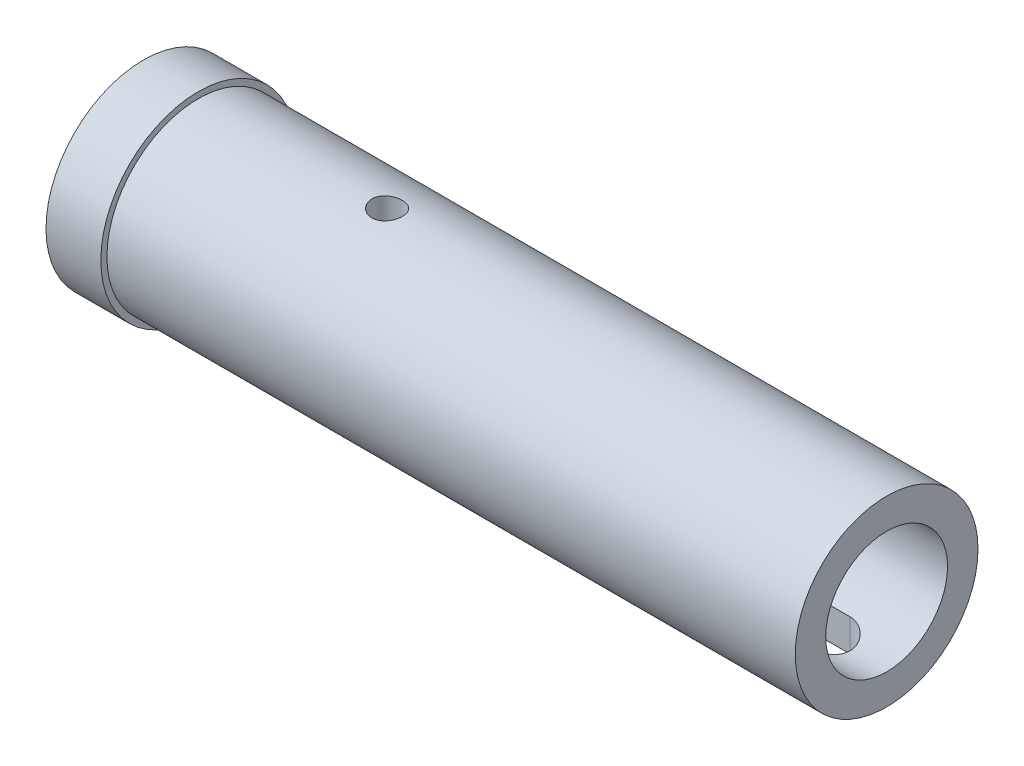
ISO-10303-21;
HEADER;
FILE_DESCRIPTION(('STEP AP214'),'2;1');
FILE_NAME('part.step','',(''),(''),'','','');
FILE_SCHEMA(('AUTOMOTIVE_DESIGN { 1 0 10303 214 1 1 1 1 }'));
ENDSEC;
DATA;
#1=APPLICATION_CONTEXT('core data for automotive mechanical design processes');
#2=APPLICATION_PROTOCOL_DEFINITION('international standard','automotive_design',2000,#1);
#3=PRODUCT_CONTEXT('',#1,'mechanical');
#4=PRODUCT('Part','Part','',(#3));
#5=PRODUCT_RELATED_PRODUCT_CATEGORY('part','',(#4));
#6=PRODUCT_DEFINITION_FORMATION('','',#4);
#7=PRODUCT_DEFINITION_CONTEXT('part definition',#1,'design');
#8=PRODUCT_DEFINITION('design','',#6,#7);
#9=PRODUCT_DEFINITION_SHAPE('','',#8);
#10=(LENGTH_UNIT() NAMED_UNIT(*) SI_UNIT(.MILLI.,.METRE.));
#11=(NAMED_UNIT(*) PLANE_ANGLE_UNIT() SI_UNIT($,.RADIAN.));
#12=(NAMED_UNIT(*) SI_UNIT($,.STERADIAN.) SOLID_ANGLE_UNIT());
#13=UNCERTAINTY_MEASURE_WITH_UNIT(LENGTH_MEASURE(1.E-05),#10,'distance_accuracy_value','');
#14=(GEOMETRIC_REPRESENTATION_CONTEXT(3) GLOBAL_UNCERTAINTY_ASSIGNED_CONTEXT((#13)) GLOBAL_UNIT_ASSIGNED_CONTEXT((#10,
#11,#12)) REPRESENTATION_CONTEXT('',''));
#15=CARTESIAN_POINT('',(0.,0.,0.));
#16=DIRECTION('',(0.,0.,1.));
#17=DIRECTION('',(1.,0.,0.));
#18=AXIS2_PLACEMENT_3D('',#15,#16,#17);
#19=CARTESIAN_POINT('',(50.001,0.,0.));
#20=DIRECTION('',(-1.,0.,0.));
#21=DIRECTION('',(0.,0.,1.));
#22=AXIS2_PLACEMENT_3D('',#19,#20,#21);
#23=CYLINDRICAL_SURFACE('',#22,10.);
#24=CARTESIAN_POINT('',(-60.,0.,0.));
#25=DIRECTION('',(-1.,0.,0.));
#26=DIRECTION('',(0.,0.,1.));
#27=AXIS2_PLACEMENT_3D('',#24,#25,#26);
#28=CIRCLE('',#27,10.);
#29=CARTESIAN_POINT('',(-60.,0.,10.));
#30=VERTEX_POINT('',#29);
#31=EDGE_CURVE('E42',#30,#30,#28,.F.);
#32=ORIENTED_EDGE('',*,*,#31,.F.);
#33=EDGE_LOOP('',(#32));
#34=FACE_BOUND('',#33,.T.);
#35=CARTESIAN_POINT('',(50.,0.,0.));
#36=DIRECTION('',(1.,0.,0.));
#37=DIRECTION('',(0.,0.,-1.));
#38=AXIS2_PLACEMENT_3D('',#35,#36,#37);
#39=CIRCLE('',#38,10.);
#40=CARTESIAN_POINT('',(50.,0.,-10.));
#41=VERTEX_POINT('',#40);
#42=EDGE_CURVE('E129',#41,#41,#39,.F.);
#43=ORIENTED_EDGE('',*,*,#42,.F.);
#44=EDGE_LOOP('',(#43));
#45=FACE_BOUND('',#44,.T.);
#46=DIRECTION('',(-1.,0.,0.));
#47=VECTOR('',#46,1.);
#48=CARTESIAN_POINT('',(50.001,-9.16515138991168,4.));
#49=LINE('',#48,#47);
#50=CARTESIAN_POINT('',(3.00000000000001,-9.16515138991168,4.));
#51=VERTEX_POINT('',#50);
#52=CARTESIAN_POINT('',(40.,-9.16515138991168,4.));
#53=VERTEX_POINT('',#52);
#54=EDGE_CURVE('E130',#51,#53,#49,.F.);
#55=ORIENTED_EDGE('',*,*,#54,.F.);
#56=CARTESIAN_POINT('',(3.00000000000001,-9.16515138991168,-4.));
#57=CARTESIAN_POINT('',(2.89238829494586,-9.16512928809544,-4.00001596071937));
#58=CARTESIAN_POINT('',(2.78478866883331,-9.16704612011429,-3.99565782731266));
#59=CARTESIAN_POINT('',(2.57045740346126,-9.17459250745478,-3.9783181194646));
#60=CARTESIAN_POINT('',(2.46372544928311,-9.18022064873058,-3.96533982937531));
#61=CARTESIAN_POINT('',(2.25230635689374,-9.19499565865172,-3.93095207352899));
#62=CARTESIAN_POINT('',(2.14761283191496,-9.20412861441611,-3.90957593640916));
#63=CARTESIAN_POINT('',(1.94059845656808,-9.22560106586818,-3.85863260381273));
#64=CARTESIAN_POINT('',(1.83827775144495,-9.23794075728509,-3.82906490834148));
#65=CARTESIAN_POINT('',(1.53612829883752,-9.2791858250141,-3.72853943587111));
#66=CARTESIAN_POINT('',(1.34069153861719,-9.3123489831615,-3.64568978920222));
#67=CARTESIAN_POINT('',(0.966408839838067,-9.3862474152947,-3.45096383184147));
#68=CARTESIAN_POINT('',(0.787578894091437,-9.42698987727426,-3.33905992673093));
#69=CARTESIAN_POINT('',(0.441475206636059,-9.51401998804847,-3.08263671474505));
#70=CARTESIAN_POINT('',(0.275265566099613,-9.56048491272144,-2.936738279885));
#71=CARTESIAN_POINT('',(-0.0310805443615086,-9.652255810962,-2.61939292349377));
#72=CARTESIAN_POINT('',(-0.171211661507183,-9.69756154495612,-2.44794076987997));
#73=CARTESIAN_POINT('',(-0.426812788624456,-9.78406834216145,-2.07601181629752));
#74=CARTESIAN_POINT('',(-0.541089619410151,-9.82503649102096,-1.87465586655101));
#75=CARTESIAN_POINT('',(-0.733688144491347,-9.89607888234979,-1.45364828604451));
#76=CARTESIAN_POINT('',(-0.81202484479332,-9.92615767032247,-1.2340043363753));
#77=CARTESIAN_POINT('',(-0.926682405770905,-9.97076629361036,-0.793934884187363));
#78=CARTESIAN_POINT('',(-0.964853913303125,-9.98597845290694,-0.574062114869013));
#79=CARTESIAN_POINT('',(-1.00405694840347,-10.001606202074,-0.130536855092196));
#80=CARTESIAN_POINT('',(-1.00510163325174,-10.0020270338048,0.0931142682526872));
#81=CARTESIAN_POINT('',(-0.971034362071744,-9.98843920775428,0.52446673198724));
#82=CARTESIAN_POINT('',(-0.937950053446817,-9.97523973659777,0.73235833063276));
#83=CARTESIAN_POINT('',(-0.840012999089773,-9.93698538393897,1.13934964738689));
#84=CARTESIAN_POINT('',(-0.775158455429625,-9.91192983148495,1.33844886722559));
#85=CARTESIAN_POINT('',(-0.61472796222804,-9.85193670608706,1.72579479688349));
#86=CARTESIAN_POINT('',(-0.518703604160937,-9.81685584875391,1.91383264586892));
#87=CARTESIAN_POINT('',(-0.299068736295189,-9.74029168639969,2.27161599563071));
#88=CARTESIAN_POINT('',(-0.175448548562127,-9.69880613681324,2.44135504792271));
#89=CARTESIAN_POINT('',(0.105280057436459,-9.61043706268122,2.76952257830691));
#90=CARTESIAN_POINT('',(0.264053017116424,-9.56337795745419,2.92647922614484));
#91=CARTESIAN_POINT('',(0.605992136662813,-9.47123359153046,3.21221470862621));
#92=CARTESIAN_POINT('',(0.789169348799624,-9.42614923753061,3.34098070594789));
#93=CARTESIAN_POINT('',(1.08163564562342,-9.36326134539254,3.51186134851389));
#94=CARTESIAN_POINT('',(1.18367183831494,-9.34283170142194,3.56571263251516));
#95=CARTESIAN_POINT('',(1.39239230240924,-9.30450957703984,3.6645476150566));
#96=CARTESIAN_POINT('',(1.49907454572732,-9.28661600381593,3.70953513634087));
#97=CARTESIAN_POINT('',(1.71622893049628,-9.25400250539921,3.79016254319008));
#98=CARTESIAN_POINT('',(1.82669617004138,-9.2392786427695,3.82581403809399));
#99=CARTESIAN_POINT('',(2.05066836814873,-9.2135146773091,3.88744848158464));
#100=CARTESIAN_POINT('',(2.16417194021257,-9.20247292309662,3.91343576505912));
#101=CARTESIAN_POINT('',(2.39744544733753,-9.18417798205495,3.95619393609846));
#102=CARTESIAN_POINT('',(2.51729419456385,-9.17707470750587,3.9726012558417));
#103=CARTESIAN_POINT('',(2.75809092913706,-9.16754485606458,3.99451448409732));
#104=CARTESIAN_POINT('',(2.87903819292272,-9.16511539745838,4.0000271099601));
#105=CARTESIAN_POINT('',(3.00000000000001,-9.16515138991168,4.));
#106=B_SPLINE_CURVE_WITH_KNOTS('',3,(#56,#57,#58,#59,#60,#61,#62,#63,#64,#65,#66,#67,#68,#69,
#70,#71,#72,#73,#74,#75,#76,#77,#78,#79,#80,#81,#82,#83,#84,#85,#86,#87,#88,#89,#90,#91,#92,#93,
#94,#95,#96,#97,#98,#99,#100,#101,#102,#103,#104,#105),.UNSPECIFIED.,.F.,.F.,(4,2,2,2,2,2,2,2,2,
2,2,2,2,2,2,2,2,2,2,2,2,2,2,2,4),(0.,0.322709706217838,0.645296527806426,0.966615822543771,
1.28795473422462,1.9293660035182,2.57138869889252,3.24636095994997,3.92147161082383,
4.62325717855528,5.32474946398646,5.99227753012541,6.65956903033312,7.28937830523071,
7.91922322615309,8.55856353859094,9.19812842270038,9.87963749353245,10.5614562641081,
10.9125878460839,11.2635676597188,11.614108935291,11.964492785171,12.3274303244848,
12.6901440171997),.UNSPECIFIED.);
#107=CARTESIAN_POINT('',(3.00000000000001,-9.16515138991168,-4.));
#108=VERTEX_POINT('',#107);
#109=EDGE_CURVE('E132',#108,#51,#106,.T.);
#110=ORIENTED_EDGE('',*,*,#109,.F.);
#111=DIRECTION('',(-1.,0.,0.));
#112=VECTOR('',#111,1.);
#113=CARTESIAN_POINT('',(50.001,-9.16515138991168,-4.));
#114=LINE('',#113,#112);
#115=CARTESIAN_POINT('',(40.,-9.16515138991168,-4.));
#116=VERTEX_POINT('',#115);
#117=EDGE_CURVE('E141',#116,#108,#114,.T.);
#118=ORIENTED_EDGE('',*,*,#117,.F.);
#119=CARTESIAN_POINT('',(40.,-9.16515138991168,4.));
#120=CARTESIAN_POINT('',(40.1076117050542,-9.16512928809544,4.00001596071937));
#121=CARTESIAN_POINT('',(40.2152113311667,-9.16704612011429,3.99565782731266));
#122=CARTESIAN_POINT('',(40.4295425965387,-9.17459250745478,3.9783181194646));
#123=CARTESIAN_POINT('',(40.5362745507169,-9.18022064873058,3.96533982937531));
#124=CARTESIAN_POINT('',(40.7476936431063,-9.19499565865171,3.93095207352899));
#125=CARTESIAN_POINT('',(40.8523871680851,-9.20412861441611,3.90957593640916));
#126=CARTESIAN_POINT('',(41.0594015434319,-9.22560106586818,3.85863260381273));
#127=CARTESIAN_POINT('',(41.1617222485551,-9.23794075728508,3.82906490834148));
#128=CARTESIAN_POINT('',(41.4638717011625,-9.2791858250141,3.72853943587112));
#129=CARTESIAN_POINT('',(41.6593084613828,-9.3123489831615,3.64568978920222));
#130=CARTESIAN_POINT('',(42.0335911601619,-9.38624741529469,3.45096383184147));
#131=CARTESIAN_POINT('',(42.2124211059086,-9.42698987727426,3.33905992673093));
#132=CARTESIAN_POINT('',(42.558524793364,-9.51401998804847,3.08263671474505));
#133=CARTESIAN_POINT('',(42.7247344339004,-9.56048491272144,2.936738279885));
#134=CARTESIAN_POINT('',(43.0310805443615,-9.652255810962,2.61939292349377));
#135=CARTESIAN_POINT('',(43.1712116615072,-9.69756154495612,2.44794076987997));
#136=CARTESIAN_POINT('',(43.4268127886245,-9.78406834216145,2.07601181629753));
#137=CARTESIAN_POINT('',(43.5410896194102,-9.82503649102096,1.87465586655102));
#138=CARTESIAN_POINT('',(43.7336881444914,-9.89607888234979,1.45364828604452));
#139=CARTESIAN_POINT('',(43.8120248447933,-9.92615767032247,1.2340043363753));
#140=CARTESIAN_POINT('',(43.9266824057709,-9.97076629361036,0.793934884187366));
#141=CARTESIAN_POINT('',(43.9648539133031,-9.98597845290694,0.574062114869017));
#142=CARTESIAN_POINT('',(44.0040569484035,-10.001606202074,0.130536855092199));
#143=CARTESIAN_POINT('',(44.0051016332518,-10.0020270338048,-0.0931142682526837));
#144=CARTESIAN_POINT('',(43.9710343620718,-9.98843920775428,-0.524466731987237));
#145=CARTESIAN_POINT('',(43.9379500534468,-9.97523973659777,-0.732358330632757));
#146=CARTESIAN_POINT('',(43.8400129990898,-9.93698538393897,-1.13934964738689));
#147=CARTESIAN_POINT('',(43.7751584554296,-9.91192983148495,-1.33844886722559));
#148=CARTESIAN_POINT('',(43.6147279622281,-9.85193670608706,-1.72579479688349));
#149=CARTESIAN_POINT('',(43.518703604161,-9.81685584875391,-1.91383264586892));
#150=CARTESIAN_POINT('',(43.2990687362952,-9.74029168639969,-2.27161599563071));
#151=CARTESIAN_POINT('',(43.1754485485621,-9.69880613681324,-2.4413550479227));
#152=CARTESIAN_POINT('',(42.8947199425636,-9.61043706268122,-2.76952257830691));
#153=CARTESIAN_POINT('',(42.7359469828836,-9.56337795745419,-2.92647922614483));
#154=CARTESIAN_POINT('',(42.3940078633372,-9.47123359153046,-3.2122147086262));
#155=CARTESIAN_POINT('',(42.2108306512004,-9.42614923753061,-3.34098070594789));
#156=CARTESIAN_POINT('',(41.9183643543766,-9.36326134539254,-3.51186134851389));
#157=CARTESIAN_POINT('',(41.8163281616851,-9.34283170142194,-3.56571263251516));
#158=CARTESIAN_POINT('',(41.6076076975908,-9.30450957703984,-3.6645476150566));
#159=CARTESIAN_POINT('',(41.5009254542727,-9.28661600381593,-3.70953513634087));
#160=CARTESIAN_POINT('',(41.2837710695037,-9.25400250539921,-3.79016254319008));
#161=CARTESIAN_POINT('',(41.1733038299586,-9.2392786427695,-3.82581403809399));
#162=CARTESIAN_POINT('',(40.9493316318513,-9.2135146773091,-3.88744848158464));
#163=CARTESIAN_POINT('',(40.8358280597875,-9.20247292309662,-3.91343576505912));
#164=CARTESIAN_POINT('',(40.6025545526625,-9.18417798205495,-3.95619393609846));
#165=CARTESIAN_POINT('',(40.4827058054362,-9.17707470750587,-3.9726012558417));
#166=CARTESIAN_POINT('',(40.241909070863,-9.16754485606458,-3.99451448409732));
#167=CARTESIAN_POINT('',(40.1209618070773,-9.16511539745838,-4.0000271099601));
#168=CARTESIAN_POINT('',(40.,-9.16515138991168,-4.));
#169=B_SPLINE_CURVE_WITH_KNOTS('',3,(#119,#120,#121,#122,#123,#124,#125,#126,#127,#128,#129,
#130,#131,#132,#133,#134,#135,#136,#137,#138,#139,#140,#141,#142,#143,#144,#145,#146,#147,#148,
#149,#150,#151,#152,#153,#154,#155,#156,#157,#158,#159,#160,#161,#162,#163,#164,#165,#166,#167,
#168),.UNSPECIFIED.,.F.,.F.,(4,2,2,2,2,2,2,2,2,2,2,2,2,2,2,2,2,2,2,2,2,2,2,2,4),(0.,
0.322709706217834,0.645296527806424,0.966615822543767,1.28795473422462,1.92936600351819,
2.57138869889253,3.24636095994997,3.92147161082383,4.62325717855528,5.32474946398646,
5.9922775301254,6.65956903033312,7.28937830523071,7.91922322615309,8.55856353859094,
9.19812842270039,9.87963749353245,10.5614562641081,10.9125878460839,11.2635676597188,
11.614108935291,11.964492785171,12.3274303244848,12.6901440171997),.UNSPECIFIED.);
#170=EDGE_CURVE('E54',#53,#116,#169,.T.);
#171=ORIENTED_EDGE('',*,*,#170,.F.);
#172=EDGE_LOOP('',(#55,#110,#118,#171));
#173=FACE_BOUND('',#172,.T.);
#174=CARTESIAN_POINT('',(-32.,9.68245836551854,-2.5));
#175=CARTESIAN_POINT('',(-32.1380507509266,9.6824610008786,-2.49999607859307));
#176=CARTESIAN_POINT('',(-32.2761448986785,9.68544306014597,-2.48852624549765));
#177=CARTESIAN_POINT('',(-32.5483675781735,9.69701861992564,-2.44302312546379));
#178=CARTESIAN_POINT('',(-32.6824937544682,9.7056153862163,-2.4089767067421));
#179=CARTESIAN_POINT('',(-32.9428035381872,9.7273872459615,-2.31949119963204));
#180=CARTESIAN_POINT('',(-33.0689971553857,9.74055642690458,-2.26407972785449));
#181=CARTESIAN_POINT('',(-33.3103108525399,9.76998192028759,-2.13352114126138));
#182=CARTESIAN_POINT('',(-33.4254304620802,9.78623836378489,-2.05837318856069));
#183=CARTESIAN_POINT('',(-33.6438616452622,9.82040716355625,-1.88870842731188));
#184=CARTESIAN_POINT('',(-33.74689360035,9.83834597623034,-1.79383688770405));
#185=CARTESIAN_POINT('',(-33.9357613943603,9.87362875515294,-1.58818206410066));
#186=CARTESIAN_POINT('',(-34.0215956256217,9.89097266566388,-1.47739729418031));
#187=CARTESIAN_POINT('',(-34.1747754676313,9.92340415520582,-1.24114520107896));
#188=CARTESIAN_POINT('',(-34.2418463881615,9.93845687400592,-1.11549457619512));
#189=CARTESIAN_POINT('',(-34.3538096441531,9.96430811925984,-0.854263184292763));
#190=CARTESIAN_POINT('',(-34.3987052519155,9.97510727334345,-0.718683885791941));
#191=CARTESIAN_POINT('',(-34.4641478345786,9.9910475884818,-0.444358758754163));
#192=CARTESIAN_POINT('',(-34.4851696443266,9.99629893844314,-0.305732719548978));
#193=CARTESIAN_POINT('',(-34.5037583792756,10.000935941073,-0.0268288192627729));
#194=CARTESIAN_POINT('',(-34.5013287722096,10.000322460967,0.113448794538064));
#195=CARTESIAN_POINT('',(-34.4734251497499,9.99338094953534,0.388380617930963));
#196=CARTESIAN_POINT('',(-34.4484636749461,9.98718002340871,0.523090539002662));
#197=CARTESIAN_POINT('',(-34.3770287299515,9.96990836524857,0.78634561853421));
#198=CARTESIAN_POINT('',(-34.3305541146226,9.95883737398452,0.91489044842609));
#199=CARTESIAN_POINT('',(-34.2169974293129,9.93287509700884,1.16351675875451));
#200=CARTESIAN_POINT('',(-34.1497329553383,9.91795019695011,1.28351127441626));
#201=CARTESIAN_POINT('',(-33.9966443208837,9.88589903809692,1.51068905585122));
#202=CARTESIAN_POINT('',(-33.9108169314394,9.8687723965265,1.61787008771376));
#203=CARTESIAN_POINT('',(-33.7202912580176,9.83363713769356,1.81943508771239));
#204=CARTESIAN_POINT('',(-33.6151451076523,9.81561719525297,1.91339419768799));
#205=CARTESIAN_POINT('',(-33.3904000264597,9.78115043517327,2.08244093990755));
#206=CARTESIAN_POINT('',(-33.2708004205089,9.76470369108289,2.15752769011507));
#207=CARTESIAN_POINT('',(-33.0197099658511,9.73520496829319,2.28697032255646));
#208=CARTESIAN_POINT('',(-32.8881642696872,9.72216983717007,2.34122391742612));
#209=CARTESIAN_POINT('',(-32.6174145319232,9.70118640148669,2.42671405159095));
#210=CARTESIAN_POINT('',(-32.4782121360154,9.69323700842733,2.45795551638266));
#211=CARTESIAN_POINT('',(-32.2000404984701,9.68355356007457,2.49582963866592));
#212=CARTESIAN_POINT('',(-32.061162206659,9.68166088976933,2.50309047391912));
#213=CARTESIAN_POINT('',(-31.7841780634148,9.68387343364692,2.49451699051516));
#214=CARTESIAN_POINT('',(-31.6460721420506,9.687978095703,2.4786847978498));
#215=CARTESIAN_POINT('',(-31.3768857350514,9.7015708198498,2.42492546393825));
#216=CARTESIAN_POINT('',(-31.2457272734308,9.71096970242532,2.3873640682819));
#217=CARTESIAN_POINT('',(-30.9915685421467,9.73400718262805,2.29161808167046));
#218=CARTESIAN_POINT('',(-30.8685692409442,9.74764628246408,2.2334310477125));
#219=CARTESIAN_POINT('',(-30.6315587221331,9.77796137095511,2.0967706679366));
#220=CARTESIAN_POINT('',(-30.517771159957,9.79469168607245,2.01792175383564));
#221=CARTESIAN_POINT('',(-30.3048116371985,9.82917083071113,1.84265073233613));
#222=CARTESIAN_POINT('',(-30.2056420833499,9.84691982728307,1.7462257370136));
#223=CARTESIAN_POINT('',(-30.0221889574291,9.88197403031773,1.53565680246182));
#224=CARTESIAN_POINT('',(-29.9383399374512,9.8992570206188,1.42112988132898));
#225=CARTESIAN_POINT('',(-29.7910641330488,9.93097216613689,1.17925670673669));
#226=CARTESIAN_POINT('',(-29.7276362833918,9.94540447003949,1.05191112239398));
#227=CARTESIAN_POINT('',(-29.6235539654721,9.96970115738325,0.788895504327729));
#228=CARTESIAN_POINT('',(-29.5827357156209,9.97959830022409,0.653293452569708));
#229=CARTESIAN_POINT('',(-29.5245396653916,9.99385293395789,0.376874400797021));
#230=CARTESIAN_POINT('',(-29.507157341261,9.99821149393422,0.236058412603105));
#231=CARTESIAN_POINT('',(-29.4965810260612,10.0008542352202,-0.0427088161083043));
#232=CARTESIAN_POINT('',(-29.5027457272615,9.99929947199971,-0.180634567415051));
#233=CARTESIAN_POINT('',(-29.5376195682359,9.99064741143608,-0.453418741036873));
#234=CARTESIAN_POINT('',(-29.5663280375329,9.98355027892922,-0.588277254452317));
#235=CARTESIAN_POINT('',(-29.6451305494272,9.96463582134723,-0.850427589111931));
#236=CARTESIAN_POINT('',(-29.6951086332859,9.95284411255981,-0.977756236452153));
#237=CARTESIAN_POINT('',(-29.8149264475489,9.92578222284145,-1.22229263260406));
#238=CARTESIAN_POINT('',(-29.8847686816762,9.91051160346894,-1.33949910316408));
#239=CARTESIAN_POINT('',(-30.0442880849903,9.87768124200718,-1.56350482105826));
#240=CARTESIAN_POINT('',(-30.1344003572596,9.86007542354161,-1.66998747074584));
#241=CARTESIAN_POINT('',(-30.3310571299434,9.82476622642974,-1.86653755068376));
#242=CARTESIAN_POINT('',(-30.4376057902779,9.80706282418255,-1.95660081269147));
#243=CARTESIAN_POINT('',(-30.6665035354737,9.77318689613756,-2.11940506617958));
#244=CARTESIAN_POINT('',(-30.7891103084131,9.75704909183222,-2.19179154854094));
#245=CARTESIAN_POINT('',(-31.045138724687,9.7285988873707,-2.31481724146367));
#246=CARTESIAN_POINT('',(-31.1785524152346,9.71628370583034,-2.36547227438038));
#247=CARTESIAN_POINT('',(-31.4264425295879,9.69879771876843,-2.43605632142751));
#248=CARTESIAN_POINT('',(-31.5397329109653,9.69271657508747,-2.4599829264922));
#249=CARTESIAN_POINT('',(-31.7686721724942,9.6845459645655,-2.49195573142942));
#250=CARTESIAN_POINT('',(-31.884320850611,9.6824561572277,-2.50000328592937));
#251=CARTESIAN_POINT('',(-32.,9.68245836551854,-2.5));
#252=B_SPLINE_CURVE_WITH_KNOTS('',3,(#174,#175,#176,#177,#178,#179,#180,#181,#182,#183,#184,
#185,#186,#187,#188,#189,#190,#191,#192,#193,#194,#195,#196,#197,#198,#199,#200,#201,#202,#203,
#204,#205,#206,#207,#208,#209,#210,#211,#212,#213,#214,#215,#216,#217,#218,#219,#220,#221,#222,
#223,#224,#225,#226,#227,#228,#229,#230,#231,#232,#233,#234,#235,#236,#237,#238,#239,#240,#241,
#242,#243,#244,#245,#246,#247,#248,#249,#250,#251),.UNSPECIFIED.,.T.,.F.,(4,2,2,2,2,2,2,2,2,2,2,
2,2,2,2,2,2,2,2,2,2,2,2,2,2,2,2,2,2,2,2,2,2,2,2,2,2,2,4),(0.,0.413727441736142,
0.827695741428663,1.24113072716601,1.65458326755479,2.07623954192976,2.49793521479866,
2.9255149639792,3.35303159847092,3.77188750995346,4.1906814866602,4.60018262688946,
5.00970556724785,5.42292874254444,5.83622385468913,6.26070466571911,6.68520531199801,
7.11176432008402,7.53823200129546,7.95343574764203,8.36860127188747,8.77697405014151,
9.18539521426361,9.60182845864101,10.0183301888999,10.4452533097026,10.872154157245,
11.2959207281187,11.7196054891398,12.131834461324,12.5440511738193,12.9540487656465,
13.3640980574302,13.7839709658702,14.2039503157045,14.6317647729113,15.0592672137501,
15.4059782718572,15.7526597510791),.UNSPECIFIED.);
#253=CARTESIAN_POINT('',(-32.,9.68245836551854,-2.5));
#254=VERTEX_POINT('',#253);
#255=EDGE_CURVE('E227',#254,#254,#252,.T.);
#256=ORIENTED_EDGE('',*,*,#255,.T.);
#257=EDGE_LOOP('',(#256));
#258=FACE_BOUND('',#257,.T.);
#259=ADVANCED_FACE('F38',(#34,#45,#173,#258),#23,.F.);
#260=CARTESIAN_POINT('',(50.,0.,0.));
#261=DIRECTION('',(1.,0.,0.));
#262=DIRECTION('',(0.,0.,-1.));
#263=AXIS2_PLACEMENT_3D('',#260,#261,#262);
#264=CYLINDRICAL_SURFACE('',#263,15.);
#265=DIRECTION('',(1.,0.,0.));
#266=VECTOR('',#265,1.);
#267=CARTESIAN_POINT('',(50.,-14.4568322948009,-4.));
#268=LINE('',#267,#266);
#269=CARTESIAN_POINT('',(40.,-14.4568322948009,-4.));
#270=VERTEX_POINT('',#269);
#271=CARTESIAN_POINT('',(3.00000000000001,-14.4568322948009,-4.));
#272=VERTEX_POINT('',#271);
#273=EDGE_CURVE('E11',#270,#272,#268,.F.);
#274=ORIENTED_EDGE('',*,*,#273,.T.);
#275=CARTESIAN_POINT('',(3.00000000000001,-14.4568322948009,-4.));
#276=CARTESIAN_POINT('',(2.88964175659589,-14.4568189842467,-4.00001309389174));
#277=CARTESIAN_POINT('',(2.77929147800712,-14.4580956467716,-3.99543311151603));
#278=CARTESIAN_POINT('',(2.55942134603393,-14.4631301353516,-3.97718874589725));
#279=CARTESIAN_POINT('',(2.44990134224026,-14.4668875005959,-3.96352604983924));
#280=CARTESIAN_POINT('',(2.23269834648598,-14.4767740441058,-3.92725695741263));
#281=CARTESIAN_POINT('',(2.12501191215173,-14.4828981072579,-3.90466984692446));
#282=CARTESIAN_POINT('',(1.91202513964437,-14.4973231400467,-3.85076543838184));
#283=CARTESIAN_POINT('',(1.80672484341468,-14.5056241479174,-3.81944798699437));
#284=CARTESIAN_POINT('',(1.49553658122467,-14.5334412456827,-3.71275643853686));
#285=CARTESIAN_POINT('',(1.29412506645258,-14.5558829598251,-3.62460332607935));
#286=CARTESIAN_POINT('',(0.908979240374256,-14.6060171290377,-3.4169578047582));
#287=CARTESIAN_POINT('',(0.72525079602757,-14.6337113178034,-3.29745504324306));
#288=CARTESIAN_POINT('',(0.376029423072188,-14.6920016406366,-3.0273032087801));
#289=CARTESIAN_POINT('',(0.211038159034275,-14.7226489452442,-2.87601544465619));
#290=CARTESIAN_POINT('',(-0.0915575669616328,-14.7829523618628,-2.54795832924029));
#291=CARTESIAN_POINT('',(-0.229157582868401,-14.8126083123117,-2.37118484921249));
#292=CARTESIAN_POINT('',(-0.475172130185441,-14.8681604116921,-1.99367199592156));
#293=CARTESIAN_POINT('',(-0.583083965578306,-14.8939887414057,-1.79259414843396));
#294=CARTESIAN_POINT('',(-0.763372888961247,-14.9383834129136,-1.3743557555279));
#295=CARTESIAN_POINT('',(-0.835757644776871,-14.9569513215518,-1.15719869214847));
#296=CARTESIAN_POINT('',(-0.941309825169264,-14.9843709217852,-0.718234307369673));
#297=CARTESIAN_POINT('',(-0.975337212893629,-14.9934353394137,-0.496647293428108));
#298=CARTESIAN_POINT('',(-1.00591431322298,-15.0015705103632,-0.0507319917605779));
#299=CARTESIAN_POINT('',(-1.00246948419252,-15.0006427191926,0.173595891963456));
#300=CARTESIAN_POINT('',(-0.958804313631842,-14.9890534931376,0.612629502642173));
#301=CARTESIAN_POINT('',(-0.919513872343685,-14.9786381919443,0.827435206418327));
#302=CARTESIAN_POINT('',(-0.806774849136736,-14.9495347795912,1.24728467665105));
#303=CARTESIAN_POINT('',(-0.733324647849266,-14.9308462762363,1.45232797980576));
#304=CARTESIAN_POINT('',(-0.55364003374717,-14.8869312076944,1.84920963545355));
#305=CARTESIAN_POINT('',(-0.447086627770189,-14.8616414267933,2.04089626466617));
#306=CARTESIAN_POINT('',(-0.204457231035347,-14.8072486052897,2.40398441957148));
#307=CARTESIAN_POINT('',(-0.0683760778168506,-14.7781448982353,2.57538239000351));
#308=CARTESIAN_POINT('',(0.234327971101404,-14.7182294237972,2.89854935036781));
#309=CARTESIAN_POINT('',(0.401758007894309,-14.6873926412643,3.04955722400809));
#310=CARTESIAN_POINT('',(0.760042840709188,-14.6282716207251,3.32161448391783));
#311=CARTESIAN_POINT('',(0.950904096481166,-14.5999880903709,3.4426555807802));
#312=CARTESIAN_POINT('',(1.25135328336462,-14.5618587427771,3.59932937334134));
#313=CARTESIAN_POINT('',(1.35428891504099,-14.5498268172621,3.64754371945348));
#314=CARTESIAN_POINT('',(1.56404632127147,-14.5275984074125,3.73509417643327));
#315=CARTESIAN_POINT('',(1.67086651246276,-14.5174011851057,3.77443385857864));
#316=CARTESIAN_POINT('',(1.8875194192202,-14.4991713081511,3.843867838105));
#317=CARTESIAN_POINT('',(1.99734887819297,-14.4911364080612,3.87397173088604));
#318=CARTESIAN_POINT('',(2.21927522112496,-14.4774747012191,3.92471856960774));
#319=CARTESIAN_POINT('',(2.33137102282,-14.4718467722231,3.9453659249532));
#320=CARTESIAN_POINT('',(2.53625102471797,-14.4639761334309,3.97411378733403));
#321=CARTESIAN_POINT('',(2.62879644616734,-14.4613012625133,3.98382319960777));
#322=CARTESIAN_POINT('',(2.81422535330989,-14.4577275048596,3.99676420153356));
#323=CARTESIAN_POINT('',(2.90710807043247,-14.4568258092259,4.00000603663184));
#324=CARTESIAN_POINT('',(3.00000000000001,-14.4568322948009,4.));
#325=B_SPLINE_CURVE_WITH_KNOTS('',3,(#275,#276,#277,#278,#279,#280,#281,#282,#283,#284,#285,
#286,#287,#288,#289,#290,#291,#292,#293,#294,#295,#296,#297,#298,#299,#300,#301,#302,#303,#304,
#305,#306,#307,#308,#309,#310,#311,#312,#313,#314,#315,#316,#317,#318,#319,#320,#321,#322,#323,
#324),.UNSPECIFIED.,.F.,.F.,(4,2,2,2,2,2,2,2,2,2,2,2,2,2,2,2,2,2,2,2,2,2,2,2,4),(0.,
0.330958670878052,0.661855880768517,0.992041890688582,1.32223370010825,1.98190700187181,
2.64179842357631,3.3164963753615,3.99130375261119,4.67691814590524,5.36238449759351,
6.03215661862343,6.7018311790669,7.35461236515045,8.00742449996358,8.66673340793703,
9.32615767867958,10.0057598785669,10.6855498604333,11.0281077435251,11.3705275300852,
11.7125903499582,12.0544935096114,12.3335333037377,12.6121307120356),.UNSPECIFIED.);
#326=CARTESIAN_POINT('',(3.00000000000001,-14.4568322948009,4.));
#327=VERTEX_POINT('',#326);
#328=EDGE_CURVE('E177',#272,#327,#325,.T.);
#329=ORIENTED_EDGE('',*,*,#328,.T.);
#330=DIRECTION('',(1.,0.,0.));
#331=VECTOR('',#330,1.);
#332=CARTESIAN_POINT('',(50.,-14.4568322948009,4.));
#333=LINE('',#332,#331);
#334=CARTESIAN_POINT('',(40.,-14.4568322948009,4.));
#335=VERTEX_POINT('',#334);
#336=EDGE_CURVE('E47',#327,#335,#333,.T.);
#337=ORIENTED_EDGE('',*,*,#336,.T.);
#338=CARTESIAN_POINT('',(40.,-14.4568322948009,4.));
#339=CARTESIAN_POINT('',(40.1103582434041,-14.4568189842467,4.00001309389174));
#340=CARTESIAN_POINT('',(40.2207085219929,-14.4580956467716,3.99543311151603));
#341=CARTESIAN_POINT('',(40.4405786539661,-14.4631301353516,3.97718874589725));
#342=CARTESIAN_POINT('',(40.5500986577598,-14.4668875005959,3.96352604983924));
#343=CARTESIAN_POINT('',(40.767301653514,-14.4767740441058,3.92725695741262));
#344=CARTESIAN_POINT('',(40.8749880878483,-14.4828981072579,3.90466984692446));
#345=CARTESIAN_POINT('',(41.0879748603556,-14.4973231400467,3.85076543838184));
#346=CARTESIAN_POINT('',(41.1932751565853,-14.5056241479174,3.81944798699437));
#347=CARTESIAN_POINT('',(41.5044634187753,-14.5334412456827,3.71275643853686));
#348=CARTESIAN_POINT('',(41.7058749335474,-14.5558829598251,3.62460332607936));
#349=CARTESIAN_POINT('',(42.0910207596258,-14.6060171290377,3.4169578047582));
#350=CARTESIAN_POINT('',(42.2747492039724,-14.6337113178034,3.29745504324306));
#351=CARTESIAN_POINT('',(42.6239705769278,-14.6920016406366,3.0273032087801));
#352=CARTESIAN_POINT('',(42.7889618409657,-14.7226489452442,2.87601544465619));
#353=CARTESIAN_POINT('',(43.0915575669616,-14.7829523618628,2.54795832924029));
#354=CARTESIAN_POINT('',(43.2291575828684,-14.8126083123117,2.37118484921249));
#355=CARTESIAN_POINT('',(43.4751721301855,-14.8681604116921,1.99367199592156));
#356=CARTESIAN_POINT('',(43.5830839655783,-14.8939887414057,1.79259414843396));
#357=CARTESIAN_POINT('',(43.7633728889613,-14.9383834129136,1.37435575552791));
#358=CARTESIAN_POINT('',(43.8357576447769,-14.9569513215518,1.15719869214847));
#359=CARTESIAN_POINT('',(43.9413098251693,-14.9843709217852,0.718234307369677));
#360=CARTESIAN_POINT('',(43.9753372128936,-14.9934353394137,0.496647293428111));
#361=CARTESIAN_POINT('',(44.005914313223,-15.0015705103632,0.0507319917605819));
#362=CARTESIAN_POINT('',(44.0024694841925,-15.0006427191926,-0.173595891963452));
#363=CARTESIAN_POINT('',(43.9588043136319,-14.9890534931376,-0.612629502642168));
#364=CARTESIAN_POINT('',(43.9195138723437,-14.9786381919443,-0.827435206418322));
#365=CARTESIAN_POINT('',(43.8067748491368,-14.9495347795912,-1.24728467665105));
#366=CARTESIAN_POINT('',(43.7333246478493,-14.9308462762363,-1.45232797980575));
#367=CARTESIAN_POINT('',(43.5536400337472,-14.8869312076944,-1.84920963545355));
#368=CARTESIAN_POINT('',(43.4470866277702,-14.8616414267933,-2.04089626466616));
#369=CARTESIAN_POINT('',(43.2044572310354,-14.8072486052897,-2.40398441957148));
#370=CARTESIAN_POINT('',(43.0683760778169,-14.7781448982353,-2.5753823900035));
#371=CARTESIAN_POINT('',(42.7656720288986,-14.7182294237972,-2.8985493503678));
#372=CARTESIAN_POINT('',(42.5982419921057,-14.6873926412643,-3.04955722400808));
#373=CARTESIAN_POINT('',(42.2399571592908,-14.6282716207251,-3.32161448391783));
#374=CARTESIAN_POINT('',(42.0490959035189,-14.5999880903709,-3.4426555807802));
#375=CARTESIAN_POINT('',(41.7486467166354,-14.5618587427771,-3.59932937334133));
#376=CARTESIAN_POINT('',(41.645711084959,-14.5498268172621,-3.64754371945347));
#377=CARTESIAN_POINT('',(41.4359536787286,-14.5275984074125,-3.73509417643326));
#378=CARTESIAN_POINT('',(41.3291334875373,-14.5174011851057,-3.77443385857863));
#379=CARTESIAN_POINT('',(41.1124805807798,-14.4991713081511,-3.843867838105));
#380=CARTESIAN_POINT('',(41.0026511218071,-14.4911364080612,-3.87397173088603));
#381=CARTESIAN_POINT('',(40.7807247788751,-14.4774747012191,-3.92471856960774));
#382=CARTESIAN_POINT('',(40.66862897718,-14.4718467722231,-3.9453659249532));
#383=CARTESIAN_POINT('',(40.463748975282,-14.4639761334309,-3.97411378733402));
#384=CARTESIAN_POINT('',(40.3712035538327,-14.4613012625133,-3.98382319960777));
#385=CARTESIAN_POINT('',(40.1857746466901,-14.4577275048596,-3.99676420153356));
#386=CARTESIAN_POINT('',(40.0928919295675,-14.4568258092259,-4.00000603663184));
#387=CARTESIAN_POINT('',(40.,-14.4568322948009,-4.));
#388=B_SPLINE_CURVE_WITH_KNOTS('',3,(#338,#339,#340,#341,#342,#343,#344,#345,#346,#347,#348,
#349,#350,#351,#352,#353,#354,#355,#356,#357,#358,#359,#360,#361,#362,#363,#364,#365,#366,#367,
#368,#369,#370,#371,#372,#373,#374,#375,#376,#377,#378,#379,#380,#381,#382,#383,#384,#385,#386,
#387),.UNSPECIFIED.,.F.,.F.,(4,2,2,2,2,2,2,2,2,2,2,2,2,2,2,2,2,2,2,2,2,2,2,2,4),(0.,
0.330958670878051,0.661855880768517,0.992041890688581,1.32223370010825,1.98190700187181,
2.64179842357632,3.31649637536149,3.99130375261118,4.67691814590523,5.3623844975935,
6.03215661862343,6.7018311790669,7.35461236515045,8.00742449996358,8.66673340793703,
9.32615767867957,10.0057598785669,10.6855498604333,11.0281077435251,11.3705275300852,
11.7125903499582,12.0544935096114,12.3335333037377,12.6121307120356),.UNSPECIFIED.);
#389=EDGE_CURVE('E186',#335,#270,#388,.T.);
#390=ORIENTED_EDGE('',*,*,#389,.T.);
#391=EDGE_LOOP('',(#274,#329,#337,#390));
#392=FACE_BOUND('',#391,.T.);
#393=CARTESIAN_POINT('',(50.,0.,0.));
#394=DIRECTION('',(1.,0.,0.));
#395=DIRECTION('',(0.,0.,-1.));
#396=AXIS2_PLACEMENT_3D('',#393,#394,#395);
#397=CIRCLE('',#396,15.);
#398=CARTESIAN_POINT('',(50.,0.,-15.));
#399=VERTEX_POINT('',#398);
#400=EDGE_CURVE('E165',#399,#399,#397,.T.);
#401=ORIENTED_EDGE('',*,*,#400,.F.);
#402=EDGE_LOOP('',(#401));
#403=FACE_BOUND('',#402,.T.);
#404=CARTESIAN_POINT('',(-63.,0.,0.));
#405=DIRECTION('',(1.,0.,0.));
#406=DIRECTION('',(0.,0.,-1.));
#407=AXIS2_PLACEMENT_3D('',#404,#405,#406);
#408=CIRCLE('',#407,15.);
#409=CARTESIAN_POINT('',(-63.,0.,-15.));
#410=VERTEX_POINT('',#409);
#411=EDGE_CURVE('E168',#410,#410,#408,.T.);
#412=ORIENTED_EDGE('',*,*,#411,.T.);
#413=EDGE_LOOP('',(#412));
#414=FACE_BOUND('',#413,.T.);
#415=CARTESIAN_POINT('',(-32.,14.790199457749,-2.5));
#416=CARTESIAN_POINT('',(-32.1393757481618,14.790201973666,-2.49999439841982));
#417=CARTESIAN_POINT('',(-32.2788276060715,14.7921909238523,-2.48830516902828));
#418=CARTESIAN_POINT('',(-32.5538185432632,14.7999245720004,-2.44187742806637));
#419=CARTESIAN_POINT('',(-32.6893538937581,14.8056727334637,-2.40711766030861));
#420=CARTESIAN_POINT('',(-32.9524922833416,14.8202560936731,-2.31562954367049));
#421=CARTESIAN_POINT('',(-33.0801018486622,14.8290887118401,-2.25891955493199));
#422=CARTESIAN_POINT('',(-33.3239809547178,14.8488427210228,-2.12518649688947));
#423=CARTESIAN_POINT('',(-33.4402517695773,14.8597638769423,-2.04816571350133));
#424=CARTESIAN_POINT('',(-33.6593128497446,14.8825847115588,-1.87518752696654));
#425=CARTESIAN_POINT('',(-33.7619751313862,14.8944921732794,-1.77906904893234));
#426=CARTESIAN_POINT('',(-33.9497933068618,14.9178748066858,-1.57097200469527));
#427=CARTESIAN_POINT('',(-34.0349481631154,14.9293499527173,-1.45899249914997));
#428=CARTESIAN_POINT('',(-34.1858145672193,14.9506573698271,-1.22152286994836));
#429=CARTESIAN_POINT('',(-34.2514070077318,14.9604794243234,-1.09595608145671));
#430=CARTESIAN_POINT('',(-34.3605210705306,14.9772873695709,-0.835395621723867));
#431=CARTESIAN_POINT('',(-34.4040441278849,14.9842734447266,-0.700402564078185));
#432=CARTESIAN_POINT('',(-34.4673925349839,14.9945673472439,-0.426143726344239));
#433=CARTESIAN_POINT('',(-34.4874329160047,14.9979085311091,-0.286928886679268));
#434=CARTESIAN_POINT('',(-34.5039157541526,15.0006507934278,-0.00707528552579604));
#435=CARTESIAN_POINT('',(-34.5003598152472,15.0000521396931,0.133563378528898));
#436=CARTESIAN_POINT('',(-34.4699186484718,14.9950085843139,0.410802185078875));
#437=CARTESIAN_POINT('',(-34.4432648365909,14.990601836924,0.54742853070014));
#438=CARTESIAN_POINT('',(-34.3677489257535,14.9784797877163,0.81424197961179));
#439=CARTESIAN_POINT('',(-34.3188861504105,14.9707643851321,0.944428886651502));
#440=CARTESIAN_POINT('',(-34.2001093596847,14.9528269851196,1.19535614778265));
#441=CARTESIAN_POINT('',(-34.1300999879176,14.9425936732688,1.31605052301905));
#442=CARTESIAN_POINT('',(-33.971087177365,14.920757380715,1.54406552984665));
#443=CARTESIAN_POINT('',(-33.8820822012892,14.9091542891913,1.65138507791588));
#444=CARTESIAN_POINT('',(-33.6863211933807,14.8857026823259,1.85097127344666));
#445=CARTESIAN_POINT('',(-33.579362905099,14.8738528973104,1.94303950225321));
#446=CARTESIAN_POINT('',(-33.3514129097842,14.851379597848,2.10795458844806));
#447=CARTESIAN_POINT('',(-33.2304210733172,14.8407560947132,2.18080126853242));
#448=CARTESIAN_POINT('',(-32.9776083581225,14.8219375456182,2.30524443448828));
#449=CARTESIAN_POINT('',(-32.8457755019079,14.813745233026,2.35681702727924));
#450=CARTESIAN_POINT('',(-32.5751509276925,14.8007618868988,2.43702987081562));
#451=CARTESIAN_POINT('',(-32.4363598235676,14.7959705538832,2.46567214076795));
#452=CARTESIAN_POINT('',(-32.1575338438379,14.7903895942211,2.49893188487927));
#453=CARTESIAN_POINT('',(-32.0175336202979,14.7895528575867,2.50383220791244));
#454=CARTESIAN_POINT('',(-31.7387133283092,14.7918503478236,2.49022270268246));
#455=CARTESIAN_POINT('',(-31.599893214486,14.7949844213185,2.47171377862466));
#456=CARTESIAN_POINT('',(-31.3282722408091,14.8048268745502,2.4120523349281));
#457=CARTESIAN_POINT('',(-31.195438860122,14.8115125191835,2.37104379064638));
#458=CARTESIAN_POINT('',(-30.9385298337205,14.827685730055,2.26769819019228));
#459=CARTESIAN_POINT('',(-30.8144547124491,14.8371734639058,2.20535985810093));
#460=CARTESIAN_POINT('',(-30.5773254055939,14.8579912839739,2.06045667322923));
#461=CARTESIAN_POINT('',(-30.4643834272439,14.8693375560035,1.97771056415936));
#462=CARTESIAN_POINT('',(-30.253886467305,14.8925466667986,1.79458946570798));
#463=CARTESIAN_POINT('',(-30.1563325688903,14.9044095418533,1.69421323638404));
#464=CARTESIAN_POINT('',(-29.9783481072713,14.9274642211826,1.47742807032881));
#465=CARTESIAN_POINT('',(-29.8981061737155,14.9386477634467,1.3608632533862));
#466=CARTESIAN_POINT('',(-29.7583446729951,14.9589511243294,1.11574344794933));
#467=CARTESIAN_POINT('',(-29.6988244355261,14.9680710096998,0.987188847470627));
#468=CARTESIAN_POINT('',(-29.6024894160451,14.9831835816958,0.722299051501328));
#469=CARTESIAN_POINT('',(-29.5655759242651,14.9891898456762,0.586000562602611));
#470=CARTESIAN_POINT('',(-29.5151844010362,14.9974558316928,0.30903073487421));
#471=CARTESIAN_POINT('',(-29.5017044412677,14.9997158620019,0.16835975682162));
#472=CARTESIAN_POINT('',(-29.4986181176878,15.0002303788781,-0.111541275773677));
#473=CARTESIAN_POINT('',(-29.5087247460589,14.9985330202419,-0.250768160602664));
#474=CARTESIAN_POINT('',(-29.5519039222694,14.9914217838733,-0.525511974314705));
#475=CARTESIAN_POINT('',(-29.5849763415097,14.9860079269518,-0.661028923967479));
#476=CARTESIAN_POINT('',(-29.6730381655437,14.972069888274,-0.924396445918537));
#477=CARTESIAN_POINT('',(-29.72800316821,14.9635491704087,-1.05225537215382));
#478=CARTESIAN_POINT('',(-29.8582579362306,14.9443275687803,-1.29698045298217));
#479=CARTESIAN_POINT('',(-29.9335486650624,14.9336265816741,-1.41384608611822));
#480=CARTESIAN_POINT('',(-30.1033350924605,14.9110762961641,-1.63471294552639));
#481=CARTESIAN_POINT('',(-30.1980409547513,14.8992152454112,-1.73855143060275));
#482=CARTESIAN_POINT('',(-30.4035283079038,14.8757630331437,-1.92896387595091));
#483=CARTESIAN_POINT('',(-30.5143135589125,14.8641719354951,-2.0155337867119));
#484=CARTESIAN_POINT('',(-30.7497453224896,14.8424834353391,-2.16951427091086));
#485=CARTESIAN_POINT('',(-30.8744843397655,14.8323971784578,-2.2367849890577));
#486=CARTESIAN_POINT('',(-31.1336092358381,14.8149921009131,-2.34931453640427));
#487=CARTESIAN_POINT('',(-31.2679853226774,14.8076705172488,-2.39459535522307));
#488=CARTESIAN_POINT('',(-31.5024037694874,14.7982474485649,-2.45202605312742));
#489=CARTESIAN_POINT('',(-31.6010268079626,14.7952462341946,-2.46998741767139));
#490=CARTESIAN_POINT('',(-31.7997534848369,14.7912213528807,-2.49397629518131));
#491=CARTESIAN_POINT('',(-31.8998570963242,14.7901976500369,-2.50000402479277));
#492=CARTESIAN_POINT('',(-32.,14.790199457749,-2.5));
#493=B_SPLINE_CURVE_WITH_KNOTS('',3,(#415,#416,#417,#418,#419,#420,#421,#422,#423,#424,#425,
#426,#427,#428,#429,#430,#431,#432,#433,#434,#435,#436,#437,#438,#439,#440,#441,#442,#443,#444,
#445,#446,#447,#448,#449,#450,#451,#452,#453,#454,#455,#456,#457,#458,#459,#460,#461,#462,#463,
#464,#465,#466,#467,#468,#469,#470,#471,#472,#473,#474,#475,#476,#477,#478,#479,#480,#481,#482,
#483,#484,#485,#486,#487,#488,#489,#490,#491,#492),.UNSPECIFIED.,.T.,.F.,(4,2,2,2,2,2,2,2,2,2,2,
2,2,2,2,2,2,2,2,2,2,2,2,2,2,2,2,2,2,2,2,2,2,2,2,2,2,2,4),(0.,0.417761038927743,0.83590751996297,
1.25370499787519,1.67145547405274,2.09289159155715,2.51435267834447,2.93832980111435,
3.36227935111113,3.78231567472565,4.20232344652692,4.61817121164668,5.03403164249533,
5.45179604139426,5.86959426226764,6.29246123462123,6.71533210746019,7.13867662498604,
7.56198385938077,7.9802354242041,8.39847083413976,8.81406064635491,9.22967532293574,
9.64912342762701,10.0686010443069,10.4924411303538,10.916267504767,11.3382298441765,
11.7601574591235,12.1769777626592,12.5937957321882,13.0101503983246,13.4265248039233,
13.8476699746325,14.2689137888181,14.6931372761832,15.1169356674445,15.4171067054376,
15.7172722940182),.UNSPECIFIED.);
#494=CARTESIAN_POINT('',(-32.,14.790199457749,-2.5));
#495=VERTEX_POINT('',#494);
#496=EDGE_CURVE('E229',#495,#495,#493,.T.);
#497=ORIENTED_EDGE('',*,*,#496,.F.);
#498=EDGE_LOOP('',(#497));
#499=FACE_BOUND('',#498,.T.);
#500=ADVANCED_FACE('F193',(#392,#403,#414,#499),#264,.T.);
#501=CARTESIAN_POINT('',(50.,15.,0.));
#502=DIRECTION('',(1.,0.,0.));
#503=DIRECTION('',(0.,0.,-1.));
#504=AXIS2_PLACEMENT_3D('',#501,#502,#503);
#505=PLANE('',#504);
#506=ORIENTED_EDGE('',*,*,#42,.T.);
#507=EDGE_LOOP('',(#506));
#508=FACE_BOUND('',#507,.T.);
#509=ORIENTED_EDGE('',*,*,#400,.T.);
#510=EDGE_LOOP('',(#509));
#511=FACE_BOUND('',#510,.T.);
#512=ADVANCED_FACE('F40',(#508,#511),#505,.T.);
#513=CARTESIAN_POINT('',(-72.,0.,0.));
#514=DIRECTION('',(-1.,0.,0.));
#515=DIRECTION('',(0.,0.,1.));
#516=AXIS2_PLACEMENT_3D('',#513,#514,#515);
#517=PLANE('',#516);
#518=CARTESIAN_POINT('',(-72.,0.,0.));
#519=DIRECTION('',(-1.,0.,0.));
#520=DIRECTION('',(0.,0.,1.));
#521=AXIS2_PLACEMENT_3D('',#518,#519,#520);
#522=CIRCLE('',#521,11.);
#523=CARTESIAN_POINT('',(-72.,0.,11.));
#524=VERTEX_POINT('',#523);
#525=EDGE_CURVE('E109',#524,#524,#522,.T.);
#526=ORIENTED_EDGE('',*,*,#525,.F.);
#527=EDGE_LOOP('',(#526));
#528=FACE_BOUND('',#527,.T.);
#529=CARTESIAN_POINT('',(-72.,0.,-14.));
#530=DIRECTION('',(-1.,0.,0.));
#531=DIRECTION('',(0.,0.,1.));
#532=AXIS2_PLACEMENT_3D('',#529,#530,#531);
#533=CIRCLE('',#532,1.24999999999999);
#534=CARTESIAN_POINT('',(-72.,0.,-12.75));
#535=VERTEX_POINT('',#534);
#536=EDGE_CURVE('E101',#535,#535,#533,.T.);
#537=ORIENTED_EDGE('',*,*,#536,.F.);
#538=EDGE_LOOP('',(#537));
#539=FACE_BOUND('',#538,.T.);
#540=CARTESIAN_POINT('',(-72.,14.,0.));
#541=DIRECTION('',(-1.,0.,0.));
#542=DIRECTION('',(0.,0.,1.));
#543=AXIS2_PLACEMENT_3D('',#540,#541,#542);
#544=CIRCLE('',#543,1.24999999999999);
#545=CARTESIAN_POINT('',(-72.,14.,1.24999999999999));
#546=VERTEX_POINT('',#545);
#547=EDGE_CURVE('E114',#546,#546,#544,.T.);
#548=ORIENTED_EDGE('',*,*,#547,.F.);
#549=EDGE_LOOP('',(#548));
#550=FACE_BOUND('',#549,.T.);
#551=CARTESIAN_POINT('',(-72.,0.,14.));
#552=DIRECTION('',(-1.,0.,0.));
#553=DIRECTION('',(0.,0.,1.));
#554=AXIS2_PLACEMENT_3D('',#551,#552,#553);
#555=CIRCLE('',#554,1.24999999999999);
#556=CARTESIAN_POINT('',(-72.,0.,15.25));
#557=VERTEX_POINT('',#556);
#558=EDGE_CURVE('E120',#557,#557,#555,.T.);
#559=ORIENTED_EDGE('',*,*,#558,.F.);
#560=EDGE_LOOP('',(#559));
#561=FACE_BOUND('',#560,.T.);
#562=CARTESIAN_POINT('',(-72.,-14.,0.));
#563=DIRECTION('',(-1.,0.,0.));
#564=DIRECTION('',(0.,0.,1.));
#565=AXIS2_PLACEMENT_3D('',#562,#563,#564);
#566=CIRCLE('',#565,1.24999999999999);
#567=CARTESIAN_POINT('',(-72.,-14.,1.24999999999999));
#568=VERTEX_POINT('',#567);
#569=EDGE_CURVE('E126',#568,#568,#566,.T.);
#570=ORIENTED_EDGE('',*,*,#569,.F.);
#571=EDGE_LOOP('',(#570));
#572=FACE_BOUND('',#571,.T.);
#573=CARTESIAN_POINT('',(-72.,0.,0.));
#574=DIRECTION('',(1.,0.,0.));
#575=DIRECTION('',(0.,0.,-1.));
#576=AXIS2_PLACEMENT_3D('',#573,#574,#575);
#577=CIRCLE('',#576,16.);
#578=CARTESIAN_POINT('',(-72.,0.,-16.));
#579=VERTEX_POINT('',#578);
#580=EDGE_CURVE('E174',#579,#579,#577,.T.);
#581=ORIENTED_EDGE('',*,*,#580,.F.);
#582=EDGE_LOOP('',(#581));
#583=FACE_BOUND('',#582,.T.);
#584=ADVANCED_FACE('F286',(#528,#539,#550,#561,#572,#583),#517,.T.);
#585=CARTESIAN_POINT('',(50.,0.,0.));
#586=DIRECTION('',(1.,0.,0.));
#587=DIRECTION('',(0.,0.,-1.));
#588=AXIS2_PLACEMENT_3D('',#585,#586,#587);
#589=CYLINDRICAL_SURFACE('',#588,16.);
#590=ORIENTED_EDGE('',*,*,#580,.T.);
#591=EDGE_LOOP('',(#590));
#592=FACE_BOUND('',#591,.T.);
#593=CARTESIAN_POINT('',(-63.,0.,0.));
#594=DIRECTION('',(1.,0.,0.));
#595=DIRECTION('',(0.,0.,-1.));
#596=AXIS2_PLACEMENT_3D('',#593,#594,#595);
#597=CIRCLE('',#596,16.);
#598=CARTESIAN_POINT('',(-63.,0.,-16.));
#599=VERTEX_POINT('',#598);
#600=EDGE_CURVE('E171',#599,#599,#597,.T.);
#601=ORIENTED_EDGE('',*,*,#600,.F.);
#602=EDGE_LOOP('',(#601));
#603=FACE_BOUND('',#602,.T.);
#604=ADVANCED_FACE('F213',(#592,#603),#589,.T.);
#605=CARTESIAN_POINT('',(-63.,16.,0.));
#606=DIRECTION('',(1.,0.,0.));
#607=DIRECTION('',(0.,0.,-1.));
#608=AXIS2_PLACEMENT_3D('',#605,#606,#607);
#609=PLANE('',#608);
#610=ORIENTED_EDGE('',*,*,#600,.T.);
#611=EDGE_LOOP('',(#610));
#612=FACE_BOUND('',#611,.T.);
#613=ORIENTED_EDGE('',*,*,#411,.F.);
#614=EDGE_LOOP('',(#613));
#615=FACE_BOUND('',#614,.T.);
#616=ADVANCED_FACE('F208',(#612,#615),#609,.T.);
#617=CARTESIAN_POINT('',(40.,-5.,0.));
#618=DIRECTION('',(0.,-1.,0.));
#619=DIRECTION('',(0.,0.,-1.));
#620=AXIS2_PLACEMENT_3D('',#617,#618,#619);
#621=CYLINDRICAL_SURFACE('',#620,4.);
#622=ORIENTED_EDGE('',*,*,#170,.T.);
#623=DIRECTION('',(0.,-1.,0.));
#624=VECTOR('',#623,1.);
#625=CARTESIAN_POINT('',(40.,-5.,-4.));
#626=LINE('',#625,#624);
#627=EDGE_CURVE('E163',#116,#270,#626,.T.);
#628=ORIENTED_EDGE('',*,*,#627,.T.);
#629=ORIENTED_EDGE('',*,*,#389,.F.);
#630=DIRECTION('',(0.,-1.,0.));
#631=VECTOR('',#630,1.);
#632=CARTESIAN_POINT('',(40.,-5.,4.));
#633=LINE('',#632,#631);
#634=EDGE_CURVE('E61',#53,#335,#633,.T.);
#635=ORIENTED_EDGE('',*,*,#634,.F.);
#636=EDGE_LOOP('',(#622,#628,#629,#635));
#637=FACE_BOUND('',#636,.T.);
#638=ADVANCED_FACE('F204',(#637),#621,.F.);
#639=CARTESIAN_POINT('',(40.,-5.,-4.));
#640=DIRECTION('',(0.,0.,1.));
#641=DIRECTION('',(1.,0.,0.));
#642=AXIS2_PLACEMENT_3D('',#639,#640,#641);
#643=PLANE('',#642);
#644=ORIENTED_EDGE('',*,*,#117,.T.);
#645=DIRECTION('',(0.,-1.,0.));
#646=VECTOR('',#645,1.);
#647=CARTESIAN_POINT('',(3.00000000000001,-5.,-4.));
#648=LINE('',#647,#646);
#649=EDGE_CURVE('E161',#108,#272,#648,.T.);
#650=ORIENTED_EDGE('',*,*,#649,.T.);
#651=ORIENTED_EDGE('',*,*,#273,.F.);
#652=ORIENTED_EDGE('',*,*,#627,.F.);
#653=EDGE_LOOP('',(#644,#650,#651,#652));
#654=FACE_BOUND('',#653,.T.);
#655=ADVANCED_FACE('F201',(#654),#643,.T.);
#656=CARTESIAN_POINT('',(3.00000000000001,-5.,0.));
#657=DIRECTION('',(0.,-1.,0.));
#658=DIRECTION('',(0.,0.,-1.));
#659=AXIS2_PLACEMENT_3D('',#656,#657,#658);
#660=CYLINDRICAL_SURFACE('',#659,4.);
#661=ORIENTED_EDGE('',*,*,#109,.T.);
#662=DIRECTION('',(0.,-1.,0.));
#663=VECTOR('',#662,1.);
#664=CARTESIAN_POINT('',(3.00000000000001,-5.,4.));
#665=LINE('',#664,#663);
#666=EDGE_CURVE('E159',#51,#327,#665,.T.);
#667=ORIENTED_EDGE('',*,*,#666,.T.);
#668=ORIENTED_EDGE('',*,*,#328,.F.);
#669=ORIENTED_EDGE('',*,*,#649,.F.);
#670=EDGE_LOOP('',(#661,#667,#668,#669));
#671=FACE_BOUND('',#670,.T.);
#672=ADVANCED_FACE('F196',(#671),#660,.F.);
#673=CARTESIAN_POINT('',(3.00000000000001,-5.,4.));
#674=DIRECTION('',(0.,0.,-1.));
#675=DIRECTION('',(-1.,0.,0.));
#676=AXIS2_PLACEMENT_3D('',#673,#674,#675);
#677=PLANE('',#676);
#678=ORIENTED_EDGE('',*,*,#54,.T.);
#679=ORIENTED_EDGE('',*,*,#634,.T.);
#680=ORIENTED_EDGE('',*,*,#336,.F.);
#681=ORIENTED_EDGE('',*,*,#666,.F.);
#682=EDGE_LOOP('',(#678,#679,#680,#681));
#683=FACE_BOUND('',#682,.T.);
#684=ADVANCED_FACE('F200',(#683),#677,.T.);
#685=CARTESIAN_POINT('',(-72.,-14.,0.));
#686=DIRECTION('',(-1.,0.,0.));
#687=DIRECTION('',(0.,0.,1.));
#688=AXIS2_PLACEMENT_3D('',#685,#686,#687);
#689=CYLINDRICAL_SURFACE('',#688,1.24999999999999);
#690=CARTESIAN_POINT('',(-65.,-14.,0.));
#691=DIRECTION('',(-1.,0.,0.));
#692=DIRECTION('',(0.,0.,1.));
#693=AXIS2_PLACEMENT_3D('',#690,#691,#692);
#694=CIRCLE('',#693,1.25);
#695=CARTESIAN_POINT('',(-65.,-14.,1.25));
#696=VERTEX_POINT('',#695);
#697=EDGE_CURVE('E123',#696,#696,#694,.T.);
#698=ORIENTED_EDGE('',*,*,#697,.F.);
#699=EDGE_LOOP('',(#698));
#700=FACE_BOUND('',#699,.T.);
#701=ORIENTED_EDGE('',*,*,#569,.T.);
#702=EDGE_LOOP('',(#701));
#703=FACE_BOUND('',#702,.T.);
#704=ADVANCED_FACE('F148',(#700,#703),#689,.F.);
#705=CARTESIAN_POINT('',(-65.,-14.,0.));
#706=DIRECTION('',(-1.,0.,0.));
#707=DIRECTION('',(0.,0.,1.));
#708=AXIS2_PLACEMENT_3D('',#705,#706,#707);
#709=CONICAL_SURFACE('',#708,1.25,1.02974425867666);
#710=CARTESIAN_POINT('',(-64.2489242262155,-14.,0.));
#711=VERTEX_POINT('',#710);
#712=VERTEX_LOOP('',#711);
#713=FACE_BOUND('',#712,.T.);
#714=ORIENTED_EDGE('',*,*,#697,.T.);
#715=EDGE_LOOP('',(#714));
#716=FACE_BOUND('',#715,.T.);
#717=ADVANCED_FACE('F273',(#713,#716),#709,.F.);
#718=CARTESIAN_POINT('',(-72.,0.,14.));
#719=DIRECTION('',(-1.,0.,0.));
#720=DIRECTION('',(0.,0.,1.));
#721=AXIS2_PLACEMENT_3D('',#718,#719,#720);
#722=CYLINDRICAL_SURFACE('',#721,1.24999999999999);
#723=CARTESIAN_POINT('',(-65.,0.,14.));
#724=DIRECTION('',(-1.,0.,0.));
#725=DIRECTION('',(0.,0.,1.));
#726=AXIS2_PLACEMENT_3D('',#723,#724,#725);
#727=CIRCLE('',#726,1.25);
#728=CARTESIAN_POINT('',(-65.,0.,15.25));
#729=VERTEX_POINT('',#728);
#730=EDGE_CURVE('E117',#729,#729,#727,.T.);
#731=ORIENTED_EDGE('',*,*,#730,.F.);
#732=EDGE_LOOP('',(#731));
#733=FACE_BOUND('',#732,.T.);
#734=ORIENTED_EDGE('',*,*,#558,.T.);
#735=EDGE_LOOP('',(#734));
#736=FACE_BOUND('',#735,.T.);
#737=ADVANCED_FACE('F270',(#733,#736),#722,.F.);
#738=CARTESIAN_POINT('',(-65.,0.,14.));
#739=DIRECTION('',(-1.,0.,0.));
#740=DIRECTION('',(0.,0.,1.));
#741=AXIS2_PLACEMENT_3D('',#738,#739,#740);
#742=CONICAL_SURFACE('',#741,1.25,1.02974425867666);
#743=CARTESIAN_POINT('',(-64.2489242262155,0.,14.));
#744=VERTEX_POINT('',#743);
#745=VERTEX_LOOP('',#744);
#746=FACE_BOUND('',#745,.T.);
#747=ORIENTED_EDGE('',*,*,#730,.T.);
#748=EDGE_LOOP('',(#747));
#749=FACE_BOUND('',#748,.T.);
#750=ADVANCED_FACE('F266',(#746,#749),#742,.F.);
#751=CARTESIAN_POINT('',(-72.,14.,0.));
#752=DIRECTION('',(-1.,0.,0.));
#753=DIRECTION('',(0.,0.,1.));
#754=AXIS2_PLACEMENT_3D('',#751,#752,#753);
#755=CYLINDRICAL_SURFACE('',#754,1.24999999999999);
#756=CARTESIAN_POINT('',(-65.,14.,0.));
#757=DIRECTION('',(-1.,0.,0.));
#758=DIRECTION('',(0.,0.,1.));
#759=AXIS2_PLACEMENT_3D('',#756,#757,#758);
#760=CIRCLE('',#759,1.25);
#761=CARTESIAN_POINT('',(-65.,14.,1.25));
#762=VERTEX_POINT('',#761);
#763=EDGE_CURVE('E104',#762,#762,#760,.T.);
#764=ORIENTED_EDGE('',*,*,#763,.F.);
#765=EDGE_LOOP('',(#764));
#766=FACE_BOUND('',#765,.T.);
#767=ORIENTED_EDGE('',*,*,#547,.T.);
#768=EDGE_LOOP('',(#767));
#769=FACE_BOUND('',#768,.T.);
#770=ADVANCED_FACE('F262',(#766,#769),#755,.F.);
#771=CARTESIAN_POINT('',(-65.,14.,0.));
#772=DIRECTION('',(-1.,0.,0.));
#773=DIRECTION('',(0.,0.,1.));
#774=AXIS2_PLACEMENT_3D('',#771,#772,#773);
#775=CONICAL_SURFACE('',#774,1.25,1.02974425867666);
#776=CARTESIAN_POINT('',(-64.2489242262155,14.,0.));
#777=VERTEX_POINT('',#776);
#778=VERTEX_LOOP('',#777);
#779=FACE_BOUND('',#778,.T.);
#780=ORIENTED_EDGE('',*,*,#763,.T.);
#781=EDGE_LOOP('',(#780));
#782=FACE_BOUND('',#781,.T.);
#783=ADVANCED_FACE('F259',(#779,#782),#775,.F.);
#784=CARTESIAN_POINT('',(-72.,0.,-14.));
#785=DIRECTION('',(-1.,0.,0.));
#786=DIRECTION('',(0.,0.,1.));
#787=AXIS2_PLACEMENT_3D('',#784,#785,#786);
#788=CYLINDRICAL_SURFACE('',#787,1.24999999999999);
#789=CARTESIAN_POINT('',(-65.,0.,-14.));
#790=DIRECTION('',(-1.,0.,0.));
#791=DIRECTION('',(0.,0.,1.));
#792=AXIS2_PLACEMENT_3D('',#789,#790,#791);
#793=CIRCLE('',#792,1.25);
#794=CARTESIAN_POINT('',(-65.,0.,-12.75));
#795=VERTEX_POINT('',#794);
#796=EDGE_CURVE('E99',#795,#795,#793,.T.);
#797=ORIENTED_EDGE('',*,*,#796,.F.);
#798=EDGE_LOOP('',(#797));
#799=FACE_BOUND('',#798,.T.);
#800=ORIENTED_EDGE('',*,*,#536,.T.);
#801=EDGE_LOOP('',(#800));
#802=FACE_BOUND('',#801,.T.);
#803=ADVANCED_FACE('F95',(#799,#802),#788,.F.);
#804=CARTESIAN_POINT('',(-65.,0.,-14.));
#805=DIRECTION('',(-1.,0.,0.));
#806=DIRECTION('',(0.,0.,1.));
#807=AXIS2_PLACEMENT_3D('',#804,#805,#806);
#808=CONICAL_SURFACE('',#807,1.25,1.02974425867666);
#809=CARTESIAN_POINT('',(-64.2489242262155,0.,-14.));
#810=VERTEX_POINT('',#809);
#811=VERTEX_LOOP('',#810);
#812=FACE_BOUND('',#811,.T.);
#813=ORIENTED_EDGE('',*,*,#796,.T.);
#814=EDGE_LOOP('',(#813));
#815=FACE_BOUND('',#814,.T.);
#816=ADVANCED_FACE('F91',(#812,#815),#808,.F.);
#817=CARTESIAN_POINT('',(-60.,0.,0.));
#818=DIRECTION('',(-1.,0.,0.));
#819=DIRECTION('',(0.,0.,1.));
#820=AXIS2_PLACEMENT_3D('',#817,#818,#819);
#821=PLANE('',#820);
#822=CARTESIAN_POINT('',(-60.,0.,0.));
#823=DIRECTION('',(-1.,0.,0.));
#824=DIRECTION('',(0.,0.,1.));
#825=AXIS2_PLACEMENT_3D('',#822,#823,#824);
#826=CIRCLE('',#825,11.);
#827=CARTESIAN_POINT('',(-60.,0.,11.));
#828=VERTEX_POINT('',#827);
#829=EDGE_CURVE('E107',#828,#828,#826,.T.);
#830=ORIENTED_EDGE('',*,*,#829,.T.);
#831=EDGE_LOOP('',(#830));
#832=FACE_BOUND('',#831,.T.);
#833=ORIENTED_EDGE('',*,*,#31,.T.);
#834=EDGE_LOOP('',(#833));
#835=FACE_BOUND('',#834,.T.);
#836=ADVANCED_FACE('F94',(#832,#835),#821,.T.);
#837=CARTESIAN_POINT('',(-60.,0.,0.));
#838=DIRECTION('',(-1.,0.,0.));
#839=DIRECTION('',(0.,0.,1.));
#840=AXIS2_PLACEMENT_3D('',#837,#838,#839);
#841=CYLINDRICAL_SURFACE('',#840,11.);
#842=ORIENTED_EDGE('',*,*,#829,.F.);
#843=EDGE_LOOP('',(#842));
#844=FACE_BOUND('',#843,.T.);
#845=ORIENTED_EDGE('',*,*,#525,.T.);
#846=EDGE_LOOP('',(#845));
#847=FACE_BOUND('',#846,.T.);
#848=ADVANCED_FACE('F248',(#844,#847),#841,.F.);
#849=CARTESIAN_POINT('',(-32.,16.001,0.));
#850=DIRECTION('',(0.,-1.,0.));
#851=DIRECTION('',(0.,0.,-1.));
#852=AXIS2_PLACEMENT_3D('',#849,#850,#851);
#853=CYLINDRICAL_SURFACE('',#852,2.5);
#854=ORIENTED_EDGE('',*,*,#496,.T.);
#855=EDGE_LOOP('',(#854));
#856=FACE_BOUND('',#855,.T.);
#857=ORIENTED_EDGE('',*,*,#255,.F.);
#858=EDGE_LOOP('',(#857));
#859=FACE_BOUND('',#858,.T.);
#860=ADVANCED_FACE('F242',(#856,#859),#853,.F.);
#861=CLOSED_SHELL('',(#259,#500,#512,#584,#604,#616,#638,#655,#672,#684,#704,#717,#737,#750,
#770,#783,#803,#816,#836,#848,#860));
#862=MANIFOLD_SOLID_BREP('B2',#861);
#863=ADVANCED_BREP_SHAPE_REPRESENTATION('',(#18,#862),#14);
#864=SHAPE_DEFINITION_REPRESENTATION(#9,#863);
ENDSEC;
END-ISO-10303-21;
